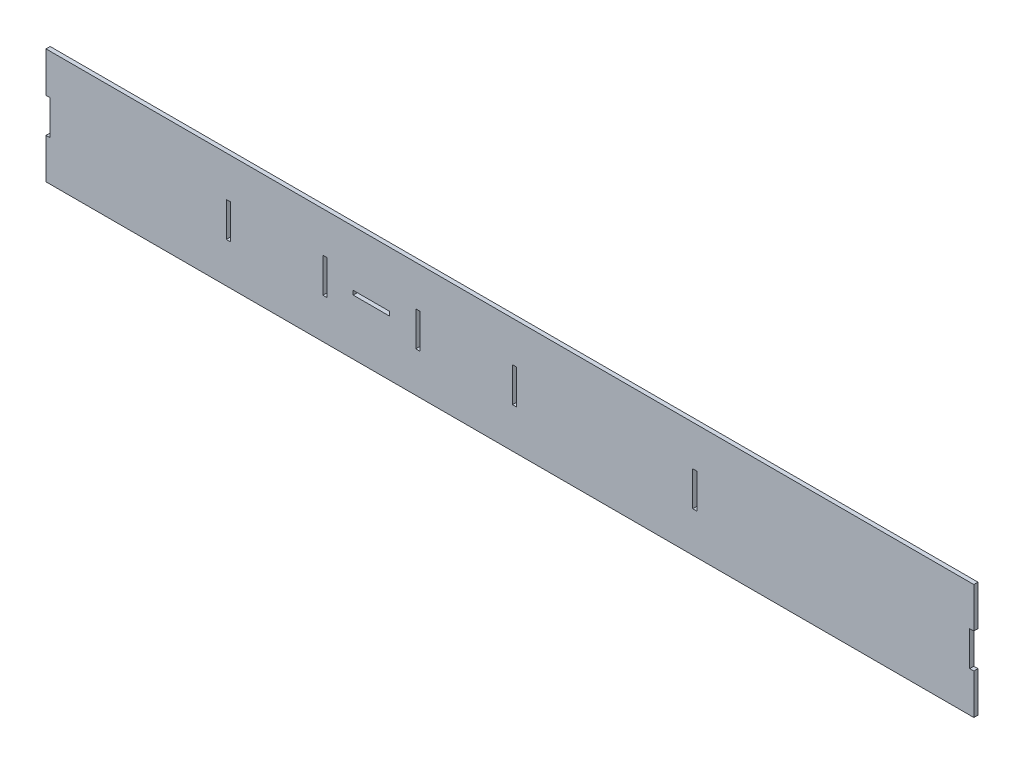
ISO-10303-21;
HEADER;
FILE_DESCRIPTION(('STEP AP214'),'2;1');
FILE_NAME('part.step','',(''),(''),'','','');
FILE_SCHEMA(('AUTOMOTIVE_DESIGN { 1 0 10303 214 1 1 1 1 }'));
ENDSEC;
DATA;
#1=APPLICATION_CONTEXT('core data for automotive mechanical design processes');
#2=APPLICATION_PROTOCOL_DEFINITION('international standard','automotive_design',2000,#1);
#3=PRODUCT_CONTEXT('',#1,'mechanical');
#4=PRODUCT('Part','Part','',(#3));
#5=PRODUCT_RELATED_PRODUCT_CATEGORY('part','',(#4));
#6=PRODUCT_DEFINITION_FORMATION('','',#4);
#7=PRODUCT_DEFINITION_CONTEXT('part definition',#1,'design');
#8=PRODUCT_DEFINITION('design','',#6,#7);
#9=PRODUCT_DEFINITION_SHAPE('','',#8);
#10=(LENGTH_UNIT() NAMED_UNIT(*) SI_UNIT(.MILLI.,.METRE.));
#11=(NAMED_UNIT(*) PLANE_ANGLE_UNIT() SI_UNIT($,.RADIAN.));
#12=(NAMED_UNIT(*) SI_UNIT($,.STERADIAN.) SOLID_ANGLE_UNIT());
#13=UNCERTAINTY_MEASURE_WITH_UNIT(LENGTH_MEASURE(1.E-05),#10,'distance_accuracy_value','');
#14=(GEOMETRIC_REPRESENTATION_CONTEXT(3) GLOBAL_UNCERTAINTY_ASSIGNED_CONTEXT((#13)) GLOBAL_UNIT_ASSIGNED_CONTEXT((#10,
#11,#12)) REPRESENTATION_CONTEXT('',''));
#15=CARTESIAN_POINT('',(0.,0.,0.));
#16=DIRECTION('',(0.,0.,1.));
#17=DIRECTION('',(1.,0.,0.));
#18=AXIS2_PLACEMENT_3D('',#15,#16,#17);
#19=CARTESIAN_POINT('',(0.,-7.86895151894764,1.524));
#20=DIRECTION('',(0.,-1.,0.));
#21=DIRECTION('',(0.,0.,-1.));
#22=AXIS2_PLACEMENT_3D('',#19,#20,#21);
#23=PLANE('',#22);
#24=DIRECTION('',(-1.,0.,0.));
#25=VECTOR('',#24,1.);
#26=CARTESIAN_POINT('',(0.,-7.86895151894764,0.));
#27=LINE('',#26,#25);
#28=CARTESIAN_POINT('',(338.849599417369,-7.86895151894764,0.));
#29=VERTEX_POINT('',#28);
#30=CARTESIAN_POINT('',(337.325599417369,-7.86895151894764,0.));
#31=VERTEX_POINT('',#30);
#32=EDGE_CURVE('E438',#29,#31,#27,.T.);
#33=ORIENTED_EDGE('',*,*,#32,.T.);
#34=DIRECTION('',(0.,0.,-1.));
#35=VECTOR('',#34,1.);
#36=CARTESIAN_POINT('',(337.325599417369,-7.86895151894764,1.524));
#37=LINE('',#36,#35);
#38=CARTESIAN_POINT('',(337.325599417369,-7.86895151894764,1.524));
#39=VERTEX_POINT('',#38);
#40=EDGE_CURVE('E495',#39,#31,#37,.T.);
#41=ORIENTED_EDGE('',*,*,#40,.F.);
#42=DIRECTION('',(-1.,0.,0.));
#43=VECTOR('',#42,1.);
#44=CARTESIAN_POINT('',(0.,-7.86895151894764,1.524));
#45=LINE('',#44,#43);
#46=CARTESIAN_POINT('',(338.849599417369,-7.86895151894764,1.524));
#47=VERTEX_POINT('',#46);
#48=EDGE_CURVE('E373',#47,#39,#45,.T.);
#49=ORIENTED_EDGE('',*,*,#48,.F.);
#50=DIRECTION('',(0.,0.,-1.));
#51=VECTOR('',#50,1.);
#52=CARTESIAN_POINT('',(338.849599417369,-7.86895151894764,1.524));
#53=LINE('',#52,#51);
#54=EDGE_CURVE('E470',#47,#29,#53,.T.);
#55=ORIENTED_EDGE('',*,*,#54,.T.);
#56=EDGE_LOOP('',(#33,#41,#49,#55));
#57=FACE_BOUND('',#56,.T.);
#58=ADVANCED_FACE('F38',(#57),#23,.F.);
#59=CARTESIAN_POINT('',(337.325599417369,0.,1.524));
#60=DIRECTION('',(-1.,0.,0.));
#61=DIRECTION('',(0.,0.,1.));
#62=AXIS2_PLACEMENT_3D('',#59,#60,#61);
#63=PLANE('',#62);
#64=DIRECTION('',(0.,1.,0.));
#65=VECTOR('',#64,1.);
#66=CARTESIAN_POINT('',(337.325599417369,0.,0.));
#67=LINE('',#66,#65);
#68=CARTESIAN_POINT('',(337.325599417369,4.83104848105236,0.));
#69=VERTEX_POINT('',#68);
#70=EDGE_CURVE('E441',#31,#69,#67,.T.);
#71=ORIENTED_EDGE('',*,*,#70,.T.);
#72=DIRECTION('',(0.,0.,-1.));
#73=VECTOR('',#72,1.);
#74=CARTESIAN_POINT('',(337.325599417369,4.83104848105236,1.524));
#75=LINE('',#74,#73);
#76=CARTESIAN_POINT('',(337.325599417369,4.83104848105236,1.524));
#77=VERTEX_POINT('',#76);
#78=EDGE_CURVE('E493',#77,#69,#75,.T.);
#79=ORIENTED_EDGE('',*,*,#78,.F.);
#80=DIRECTION('',(0.,1.,0.));
#81=VECTOR('',#80,1.);
#82=CARTESIAN_POINT('',(337.325599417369,0.,1.524));
#83=LINE('',#82,#81);
#84=EDGE_CURVE('E376',#39,#77,#83,.T.);
#85=ORIENTED_EDGE('',*,*,#84,.F.);
#86=ORIENTED_EDGE('',*,*,#40,.T.);
#87=EDGE_LOOP('',(#71,#79,#85,#86));
#88=FACE_BOUND('',#87,.T.);
#89=ADVANCED_FACE('F572',(#88),#63,.F.);
#90=CARTESIAN_POINT('',(0.,4.83104848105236,1.524));
#91=DIRECTION('',(0.,-1.,0.));
#92=DIRECTION('',(0.,0.,-1.));
#93=AXIS2_PLACEMENT_3D('',#90,#91,#92);
#94=PLANE('',#93);
#95=DIRECTION('',(-1.,0.,0.));
#96=VECTOR('',#95,1.);
#97=CARTESIAN_POINT('',(0.,4.83104848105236,0.));
#98=LINE('',#97,#96);
#99=CARTESIAN_POINT('',(338.849599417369,4.83104848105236,0.));
#100=VERTEX_POINT('',#99);
#101=EDGE_CURVE('E444',#100,#69,#98,.T.);
#102=ORIENTED_EDGE('',*,*,#101,.F.);
#103=DIRECTION('',(0.,0.,-1.));
#104=VECTOR('',#103,1.);
#105=CARTESIAN_POINT('',(338.849599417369,4.83104848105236,1.524));
#106=LINE('',#105,#104);
#107=CARTESIAN_POINT('',(338.849599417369,4.83104848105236,1.524));
#108=VERTEX_POINT('',#107);
#109=EDGE_CURVE('E491',#108,#100,#106,.T.);
#110=ORIENTED_EDGE('',*,*,#109,.F.);
#111=DIRECTION('',(-1.,0.,0.));
#112=VECTOR('',#111,1.);
#113=CARTESIAN_POINT('',(0.,4.83104848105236,1.524));
#114=LINE('',#113,#112);
#115=EDGE_CURVE('E378',#108,#77,#114,.T.);
#116=ORIENTED_EDGE('',*,*,#115,.T.);
#117=ORIENTED_EDGE('',*,*,#78,.T.);
#118=EDGE_LOOP('',(#102,#110,#116,#117));
#119=FACE_BOUND('',#118,.T.);
#120=ADVANCED_FACE('F578',(#119),#94,.T.);
#121=CARTESIAN_POINT('',(338.849599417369,0.,1.524));
#122=DIRECTION('',(-1.,0.,0.));
#123=DIRECTION('',(0.,0.,1.));
#124=AXIS2_PLACEMENT_3D('',#121,#122,#123);
#125=PLANE('',#124);
#126=DIRECTION('',(0.,1.,0.));
#127=VECTOR('',#126,1.);
#128=CARTESIAN_POINT('',(338.849599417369,0.,0.));
#129=LINE('',#128,#127);
#130=CARTESIAN_POINT('',(338.849599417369,19.6067339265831,0.));
#131=VERTEX_POINT('',#130);
#132=EDGE_CURVE('E447',#100,#131,#129,.T.);
#133=ORIENTED_EDGE('',*,*,#132,.T.);
#134=DIRECTION('',(0.,0.,-1.));
#135=VECTOR('',#134,1.);
#136=CARTESIAN_POINT('',(338.849599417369,19.6067339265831,1.524));
#137=LINE('',#136,#135);
#138=CARTESIAN_POINT('',(338.849599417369,19.6067339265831,1.524));
#139=VERTEX_POINT('',#138);
#140=EDGE_CURVE('E489',#139,#131,#137,.T.);
#141=ORIENTED_EDGE('',*,*,#140,.F.);
#142=DIRECTION('',(0.,1.,0.));
#143=VECTOR('',#142,1.);
#144=CARTESIAN_POINT('',(338.849599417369,0.,1.524));
#145=LINE('',#144,#143);
#146=EDGE_CURVE('E381',#108,#139,#145,.T.);
#147=ORIENTED_EDGE('',*,*,#146,.F.);
#148=ORIENTED_EDGE('',*,*,#109,.T.);
#149=EDGE_LOOP('',(#133,#141,#147,#148));
#150=FACE_BOUND('',#149,.T.);
#151=ADVANCED_FACE('F667',(#150),#125,.F.);
#152=CARTESIAN_POINT('',(0.,19.6067339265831,1.524));
#153=DIRECTION('',(0.,1.,0.));
#154=DIRECTION('',(0.,0.,1.));
#155=AXIS2_PLACEMENT_3D('',#152,#153,#154);
#156=PLANE('',#155);
#157=DIRECTION('',(1.,0.,0.));
#158=VECTOR('',#157,1.);
#159=CARTESIAN_POINT('',(0.,19.6067339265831,0.));
#160=LINE('',#159,#158);
#161=CARTESIAN_POINT('',(-1.524,19.6067339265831,0.));
#162=VERTEX_POINT('',#161);
#163=EDGE_CURVE('E450',#162,#131,#160,.T.);
#164=ORIENTED_EDGE('',*,*,#163,.F.);
#165=DIRECTION('',(0.,0.,-1.));
#166=VECTOR('',#165,1.);
#167=CARTESIAN_POINT('',(-1.524,19.6067339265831,1.524));
#168=LINE('',#167,#166);
#169=CARTESIAN_POINT('',(-1.524,19.6067339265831,1.524));
#170=VERTEX_POINT('',#169);
#171=EDGE_CURVE('E487',#170,#162,#168,.T.);
#172=ORIENTED_EDGE('',*,*,#171,.F.);
#173=DIRECTION('',(1.,0.,0.));
#174=VECTOR('',#173,1.);
#175=CARTESIAN_POINT('',(0.,19.6067339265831,1.524));
#176=LINE('',#175,#174);
#177=EDGE_CURVE('E383',#170,#139,#176,.T.);
#178=ORIENTED_EDGE('',*,*,#177,.T.);
#179=ORIENTED_EDGE('',*,*,#140,.T.);
#180=EDGE_LOOP('',(#164,#172,#178,#179));
#181=FACE_BOUND('',#180,.T.);
#182=ADVANCED_FACE('F671',(#181),#156,.T.);
#183=CARTESIAN_POINT('',(-1.524,0.,1.524));
#184=DIRECTION('',(-1.,0.,0.));
#185=DIRECTION('',(0.,0.,1.));
#186=AXIS2_PLACEMENT_3D('',#183,#184,#185);
#187=PLANE('',#186);
#188=DIRECTION('',(0.,1.,0.));
#189=VECTOR('',#188,1.);
#190=CARTESIAN_POINT('',(-1.524,0.,0.));
#191=LINE('',#190,#189);
#192=CARTESIAN_POINT('',(-1.524,4.83104848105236,0.));
#193=VERTEX_POINT('',#192);
#194=EDGE_CURVE('E453',#193,#162,#191,.T.);
#195=ORIENTED_EDGE('',*,*,#194,.F.);
#196=DIRECTION('',(0.,0.,-1.));
#197=VECTOR('',#196,1.);
#198=CARTESIAN_POINT('',(-1.524,4.83104848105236,1.524));
#199=LINE('',#198,#197);
#200=CARTESIAN_POINT('',(-1.524,4.83104848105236,1.524));
#201=VERTEX_POINT('',#200);
#202=EDGE_CURVE('E485',#201,#193,#199,.T.);
#203=ORIENTED_EDGE('',*,*,#202,.F.);
#204=DIRECTION('',(0.,1.,0.));
#205=VECTOR('',#204,1.);
#206=CARTESIAN_POINT('',(-1.524,0.,1.524));
#207=LINE('',#206,#205);
#208=EDGE_CURVE('E387',#201,#170,#207,.T.);
#209=ORIENTED_EDGE('',*,*,#208,.T.);
#210=ORIENTED_EDGE('',*,*,#171,.T.);
#211=EDGE_LOOP('',(#195,#203,#209,#210));
#212=FACE_BOUND('',#211,.T.);
#213=ADVANCED_FACE('F674',(#212),#187,.T.);
#214=CARTESIAN_POINT('',(0.,4.83104848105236,1.524));
#215=DIRECTION('',(0.,-1.,0.));
#216=DIRECTION('',(0.,0.,-1.));
#217=AXIS2_PLACEMENT_3D('',#214,#215,#216);
#218=PLANE('',#217);
#219=DIRECTION('',(-1.,0.,0.));
#220=VECTOR('',#219,1.);
#221=CARTESIAN_POINT('',(0.,4.83104848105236,0.));
#222=LINE('',#221,#220);
#223=CARTESIAN_POINT('',(0.,4.83104848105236,0.));
#224=VERTEX_POINT('',#223);
#225=EDGE_CURVE('E456',#224,#193,#222,.T.);
#226=ORIENTED_EDGE('',*,*,#225,.F.);
#227=DIRECTION('',(0.,0.,-1.));
#228=VECTOR('',#227,1.);
#229=CARTESIAN_POINT('',(0.,4.83104848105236,1.524));
#230=LINE('',#229,#228);
#231=CARTESIAN_POINT('',(0.,4.83104848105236,1.524));
#232=VERTEX_POINT('',#231);
#233=EDGE_CURVE('E483',#232,#224,#230,.T.);
#234=ORIENTED_EDGE('',*,*,#233,.F.);
#235=DIRECTION('',(-1.,0.,0.));
#236=VECTOR('',#235,1.);
#237=CARTESIAN_POINT('',(0.,4.83104848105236,1.524));
#238=LINE('',#237,#236);
#239=EDGE_CURVE('E390',#232,#201,#238,.T.);
#240=ORIENTED_EDGE('',*,*,#239,.T.);
#241=ORIENTED_EDGE('',*,*,#202,.T.);
#242=EDGE_LOOP('',(#226,#234,#240,#241));
#243=FACE_BOUND('',#242,.T.);
#244=ADVANCED_FACE('F679',(#243),#218,.T.);
#245=CARTESIAN_POINT('',(0.,0.,1.524));
#246=DIRECTION('',(-1.,0.,0.));
#247=DIRECTION('',(0.,0.,1.));
#248=AXIS2_PLACEMENT_3D('',#245,#246,#247);
#249=PLANE('',#248);
#250=DIRECTION('',(0.,1.,0.));
#251=VECTOR('',#250,1.);
#252=CARTESIAN_POINT('',(0.,0.,0.));
#253=LINE('',#252,#251);
#254=CARTESIAN_POINT('',(0.,-7.86895151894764,0.));
#255=VERTEX_POINT('',#254);
#256=EDGE_CURVE('E459',#255,#224,#253,.T.);
#257=ORIENTED_EDGE('',*,*,#256,.F.);
#258=DIRECTION('',(0.,0.,-1.));
#259=VECTOR('',#258,1.);
#260=CARTESIAN_POINT('',(0.,-7.86895151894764,1.524));
#261=LINE('',#260,#259);
#262=CARTESIAN_POINT('',(0.,-7.86895151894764,1.524));
#263=VERTEX_POINT('',#262);
#264=EDGE_CURVE('E481',#263,#255,#261,.T.);
#265=ORIENTED_EDGE('',*,*,#264,.F.);
#266=DIRECTION('',(0.,1.,0.));
#267=VECTOR('',#266,1.);
#268=CARTESIAN_POINT('',(0.,0.,1.524));
#269=LINE('',#268,#267);
#270=EDGE_CURVE('E393',#263,#232,#269,.T.);
#271=ORIENTED_EDGE('',*,*,#270,.T.);
#272=ORIENTED_EDGE('',*,*,#233,.T.);
#273=EDGE_LOOP('',(#257,#265,#271,#272));
#274=FACE_BOUND('',#273,.T.);
#275=ADVANCED_FACE('F682',(#274),#249,.T.);
#276=CARTESIAN_POINT('',(0.,-7.86895151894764,1.524));
#277=DIRECTION('',(0.,1.,0.));
#278=DIRECTION('',(0.,0.,1.));
#279=AXIS2_PLACEMENT_3D('',#276,#277,#278);
#280=PLANE('',#279);
#281=DIRECTION('',(1.,0.,0.));
#282=VECTOR('',#281,1.);
#283=CARTESIAN_POINT('',(0.,-7.86895151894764,0.));
#284=LINE('',#283,#282);
#285=CARTESIAN_POINT('',(-1.524,-7.86895151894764,0.));
#286=VERTEX_POINT('',#285);
#287=EDGE_CURVE('E462',#286,#255,#284,.T.);
#288=ORIENTED_EDGE('',*,*,#287,.F.);
#289=DIRECTION('',(0.,0.,-1.));
#290=VECTOR('',#289,1.);
#291=CARTESIAN_POINT('',(-1.524,-7.86895151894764,1.524));
#292=LINE('',#291,#290);
#293=CARTESIAN_POINT('',(-1.524,-7.86895151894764,1.524));
#294=VERTEX_POINT('',#293);
#295=EDGE_CURVE('E479',#294,#286,#292,.T.);
#296=ORIENTED_EDGE('',*,*,#295,.F.);
#297=DIRECTION('',(1.,0.,0.));
#298=VECTOR('',#297,1.);
#299=CARTESIAN_POINT('',(0.,-7.86895151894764,1.524));
#300=LINE('',#299,#298);
#301=EDGE_CURVE('E396',#294,#263,#300,.T.);
#302=ORIENTED_EDGE('',*,*,#301,.T.);
#303=ORIENTED_EDGE('',*,*,#264,.T.);
#304=EDGE_LOOP('',(#288,#296,#302,#303));
#305=FACE_BOUND('',#304,.T.);
#306=ADVANCED_FACE('F687',(#305),#280,.T.);
#307=CARTESIAN_POINT('',(-1.524,0.,1.524));
#308=DIRECTION('',(-1.,0.,0.));
#309=DIRECTION('',(0.,0.,1.));
#310=AXIS2_PLACEMENT_3D('',#307,#308,#309);
#311=PLANE('',#310);
#312=DIRECTION('',(0.,1.,0.));
#313=VECTOR('',#312,1.);
#314=CARTESIAN_POINT('',(-1.524,0.,0.));
#315=LINE('',#314,#313);
#316=CARTESIAN_POINT('',(-1.524,-22.6446369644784,0.));
#317=VERTEX_POINT('',#316);
#318=EDGE_CURVE('E465',#317,#286,#315,.T.);
#319=ORIENTED_EDGE('',*,*,#318,.F.);
#320=DIRECTION('',(0.,0.,-1.));
#321=VECTOR('',#320,1.);
#322=CARTESIAN_POINT('',(-1.524,-22.6446369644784,1.524));
#323=LINE('',#322,#321);
#324=CARTESIAN_POINT('',(-1.524,-22.6446369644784,1.524));
#325=VERTEX_POINT('',#324);
#326=EDGE_CURVE('E477',#325,#317,#323,.T.);
#327=ORIENTED_EDGE('',*,*,#326,.F.);
#328=DIRECTION('',(0.,1.,0.));
#329=VECTOR('',#328,1.);
#330=CARTESIAN_POINT('',(-1.524,0.,1.524));
#331=LINE('',#330,#329);
#332=EDGE_CURVE('E399',#325,#294,#331,.T.);
#333=ORIENTED_EDGE('',*,*,#332,.T.);
#334=ORIENTED_EDGE('',*,*,#295,.T.);
#335=EDGE_LOOP('',(#319,#327,#333,#334));
#336=FACE_BOUND('',#335,.T.);
#337=ADVANCED_FACE('F690',(#336),#311,.T.);
#338=CARTESIAN_POINT('',(0.,-22.6446369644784,1.524));
#339=DIRECTION('',(0.,1.,0.));
#340=DIRECTION('',(0.,0.,1.));
#341=AXIS2_PLACEMENT_3D('',#338,#339,#340);
#342=PLANE('',#341);
#343=DIRECTION('',(1.,0.,0.));
#344=VECTOR('',#343,1.);
#345=CARTESIAN_POINT('',(0.,-22.6446369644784,0.));
#346=LINE('',#345,#344);
#347=CARTESIAN_POINT('',(338.849599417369,-22.6446369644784,0.));
#348=VERTEX_POINT('',#347);
#349=EDGE_CURVE('E468',#317,#348,#346,.T.);
#350=ORIENTED_EDGE('',*,*,#349,.T.);
#351=DIRECTION('',(0.,0.,-1.));
#352=VECTOR('',#351,1.);
#353=CARTESIAN_POINT('',(338.849599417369,-22.6446369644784,1.524));
#354=LINE('',#353,#352);
#355=CARTESIAN_POINT('',(338.849599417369,-22.6446369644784,1.524));
#356=VERTEX_POINT('',#355);
#357=EDGE_CURVE('E473',#356,#348,#354,.T.);
#358=ORIENTED_EDGE('',*,*,#357,.F.);
#359=DIRECTION('',(1.,0.,0.));
#360=VECTOR('',#359,1.);
#361=CARTESIAN_POINT('',(0.,-22.6446369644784,1.524));
#362=LINE('',#361,#360);
#363=EDGE_CURVE('E402',#325,#356,#362,.T.);
#364=ORIENTED_EDGE('',*,*,#363,.F.);
#365=ORIENTED_EDGE('',*,*,#326,.T.);
#366=EDGE_LOOP('',(#350,#358,#364,#365));
#367=FACE_BOUND('',#366,.T.);
#368=ADVANCED_FACE('F601',(#367),#342,.F.);
#369=CARTESIAN_POINT('',(237.249599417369,0.,1.524));
#370=DIRECTION('',(-1.,0.,0.));
#371=DIRECTION('',(0.,0.,1.));
#372=AXIS2_PLACEMENT_3D('',#369,#370,#371);
#373=PLANE('',#372);
#374=DIRECTION('',(0.,1.,0.));
#375=VECTOR('',#374,1.);
#376=CARTESIAN_POINT('',(237.249599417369,0.,0.));
#377=LINE('',#376,#375);
#378=CARTESIAN_POINT('',(237.249599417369,-7.86895151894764,0.));
#379=VERTEX_POINT('',#378);
#380=CARTESIAN_POINT('',(237.249599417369,4.83104848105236,0.));
#381=VERTEX_POINT('',#380);
#382=EDGE_CURVE('E426',#379,#381,#377,.T.);
#383=ORIENTED_EDGE('',*,*,#382,.F.);
#384=DIRECTION('',(0.,0.,-1.));
#385=VECTOR('',#384,1.);
#386=CARTESIAN_POINT('',(237.249599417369,-7.86895151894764,1.524));
#387=LINE('',#386,#385);
#388=CARTESIAN_POINT('',(237.249599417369,-7.86895151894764,1.524));
#389=VERTEX_POINT('',#388);
#390=EDGE_CURVE('E474',#389,#379,#387,.T.);
#391=ORIENTED_EDGE('',*,*,#390,.F.);
#392=DIRECTION('',(0.,1.,0.));
#393=VECTOR('',#392,1.);
#394=CARTESIAN_POINT('',(237.249599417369,0.,1.524));
#395=LINE('',#394,#393);
#396=CARTESIAN_POINT('',(237.249599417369,4.83104848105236,1.524));
#397=VERTEX_POINT('',#396);
#398=EDGE_CURVE('E362',#389,#397,#395,.T.);
#399=ORIENTED_EDGE('',*,*,#398,.T.);
#400=DIRECTION('',(0.,0.,-1.));
#401=VECTOR('',#400,1.);
#402=CARTESIAN_POINT('',(237.249599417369,4.83104848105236,1.524));
#403=LINE('',#402,#401);
#404=EDGE_CURVE('E499',#397,#381,#403,.T.);
#405=ORIENTED_EDGE('',*,*,#404,.T.);
#406=EDGE_LOOP('',(#383,#391,#399,#405));
#407=FACE_BOUND('',#406,.T.);
#408=ADVANCED_FACE('F597',(#407),#373,.T.);
#409=CARTESIAN_POINT('',(0.,-7.86895151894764,1.524));
#410=DIRECTION('',(0.,1.,0.));
#411=DIRECTION('',(0.,0.,1.));
#412=AXIS2_PLACEMENT_3D('',#409,#410,#411);
#413=PLANE('',#412);
#414=DIRECTION('',(1.,0.,0.));
#415=VECTOR('',#414,1.);
#416=CARTESIAN_POINT('',(0.,-7.86895151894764,0.));
#417=LINE('',#416,#415);
#418=CARTESIAN_POINT('',(235.725599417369,-7.86895151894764,0.));
#419=VERTEX_POINT('',#418);
#420=EDGE_CURVE('E429',#419,#379,#417,.T.);
#421=ORIENTED_EDGE('',*,*,#420,.F.);
#422=DIRECTION('',(0.,0.,-1.));
#423=VECTOR('',#422,1.);
#424=CARTESIAN_POINT('',(235.725599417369,-7.86895151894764,1.524));
#425=LINE('',#424,#423);
#426=CARTESIAN_POINT('',(235.725599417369,-7.86895151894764,1.524));
#427=VERTEX_POINT('',#426);
#428=EDGE_CURVE('E505',#427,#419,#425,.T.);
#429=ORIENTED_EDGE('',*,*,#428,.F.);
#430=DIRECTION('',(1.,0.,0.));
#431=VECTOR('',#430,1.);
#432=CARTESIAN_POINT('',(0.,-7.86895151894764,1.524));
#433=LINE('',#432,#431);
#434=EDGE_CURVE('E365',#427,#389,#433,.T.);
#435=ORIENTED_EDGE('',*,*,#434,.T.);
#436=ORIENTED_EDGE('',*,*,#390,.T.);
#437=EDGE_LOOP('',(#421,#429,#435,#436));
#438=FACE_BOUND('',#437,.T.);
#439=ADVANCED_FACE('F593',(#438),#413,.T.);
#440=CARTESIAN_POINT('',(235.725599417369,0.,1.524));
#441=DIRECTION('',(-1.,0.,0.));
#442=DIRECTION('',(0.,0.,1.));
#443=AXIS2_PLACEMENT_3D('',#440,#441,#442);
#444=PLANE('',#443);
#445=DIRECTION('',(0.,1.,0.));
#446=VECTOR('',#445,1.);
#447=CARTESIAN_POINT('',(235.725599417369,0.,0.));
#448=LINE('',#447,#446);
#449=CARTESIAN_POINT('',(235.725599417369,4.83104848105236,0.));
#450=VERTEX_POINT('',#449);
#451=EDGE_CURVE('E432',#419,#450,#448,.T.);
#452=ORIENTED_EDGE('',*,*,#451,.T.);
#453=DIRECTION('',(0.,0.,-1.));
#454=VECTOR('',#453,1.);
#455=CARTESIAN_POINT('',(235.725599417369,4.83104848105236,1.524));
#456=LINE('',#455,#454);
#457=CARTESIAN_POINT('',(235.725599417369,4.83104848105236,1.524));
#458=VERTEX_POINT('',#457);
#459=EDGE_CURVE('E501',#458,#450,#456,.T.);
#460=ORIENTED_EDGE('',*,*,#459,.F.);
#461=DIRECTION('',(0.,1.,0.));
#462=VECTOR('',#461,1.);
#463=CARTESIAN_POINT('',(235.725599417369,0.,1.524));
#464=LINE('',#463,#462);
#465=EDGE_CURVE('E368',#427,#458,#464,.T.);
#466=ORIENTED_EDGE('',*,*,#465,.F.);
#467=ORIENTED_EDGE('',*,*,#428,.T.);
#468=EDGE_LOOP('',(#452,#460,#466,#467));
#469=FACE_BOUND('',#468,.T.);
#470=ADVANCED_FACE('F589',(#469),#444,.F.);
#471=CARTESIAN_POINT('',(135.649599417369,0.,1.524));
#472=DIRECTION('',(-1.,0.,0.));
#473=DIRECTION('',(0.,0.,1.));
#474=AXIS2_PLACEMENT_3D('',#471,#472,#473);
#475=PLANE('',#474);
#476=DIRECTION('',(0.,1.,0.));
#477=VECTOR('',#476,1.);
#478=CARTESIAN_POINT('',(135.649599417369,0.,0.));
#479=LINE('',#478,#477);
#480=CARTESIAN_POINT('',(135.649599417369,-7.86895151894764,0.));
#481=VERTEX_POINT('',#480);
#482=CARTESIAN_POINT('',(135.649599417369,4.83104848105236,0.));
#483=VERTEX_POINT('',#482);
#484=EDGE_CURVE('E414',#481,#483,#479,.T.);
#485=ORIENTED_EDGE('',*,*,#484,.F.);
#486=DIRECTION('',(0.,0.,-1.));
#487=VECTOR('',#486,1.);
#488=CARTESIAN_POINT('',(135.649599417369,-7.86895151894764,1.524));
#489=LINE('',#488,#487);
#490=CARTESIAN_POINT('',(135.649599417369,-7.86895151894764,1.524));
#491=VERTEX_POINT('',#490);
#492=EDGE_CURVE('E502',#491,#481,#489,.T.);
#493=ORIENTED_EDGE('',*,*,#492,.F.);
#494=DIRECTION('',(0.,1.,0.));
#495=VECTOR('',#494,1.);
#496=CARTESIAN_POINT('',(135.649599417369,0.,1.524));
#497=LINE('',#496,#495);
#498=CARTESIAN_POINT('',(135.649599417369,4.83104848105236,1.524));
#499=VERTEX_POINT('',#498);
#500=EDGE_CURVE('E351',#491,#499,#497,.T.);
#501=ORIENTED_EDGE('',*,*,#500,.T.);
#502=DIRECTION('',(0.,0.,-1.));
#503=VECTOR('',#502,1.);
#504=CARTESIAN_POINT('',(135.649599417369,4.83104848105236,1.524));
#505=LINE('',#504,#503);
#506=EDGE_CURVE('E508',#499,#483,#505,.T.);
#507=ORIENTED_EDGE('',*,*,#506,.T.);
#508=EDGE_LOOP('',(#485,#493,#501,#507));
#509=FACE_BOUND('',#508,.T.);
#510=ADVANCED_FACE('F592',(#509),#475,.T.);
#511=CARTESIAN_POINT('',(0.,-7.86895151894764,1.524));
#512=DIRECTION('',(0.,1.,0.));
#513=DIRECTION('',(0.,0.,1.));
#514=AXIS2_PLACEMENT_3D('',#511,#512,#513);
#515=PLANE('',#514);
#516=DIRECTION('',(1.,0.,0.));
#517=VECTOR('',#516,1.);
#518=CARTESIAN_POINT('',(0.,-7.86895151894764,0.));
#519=LINE('',#518,#517);
#520=CARTESIAN_POINT('',(134.125599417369,-7.86895151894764,0.));
#521=VERTEX_POINT('',#520);
#522=EDGE_CURVE('E417',#521,#481,#519,.T.);
#523=ORIENTED_EDGE('',*,*,#522,.F.);
#524=DIRECTION('',(0.,0.,-1.));
#525=VECTOR('',#524,1.);
#526=CARTESIAN_POINT('',(134.125599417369,-7.86895151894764,1.524));
#527=LINE('',#526,#525);
#528=CARTESIAN_POINT('',(134.125599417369,-7.86895151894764,1.524));
#529=VERTEX_POINT('',#528);
#530=EDGE_CURVE('E514',#529,#521,#527,.T.);
#531=ORIENTED_EDGE('',*,*,#530,.F.);
#532=DIRECTION('',(1.,0.,0.));
#533=VECTOR('',#532,1.);
#534=CARTESIAN_POINT('',(0.,-7.86895151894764,1.524));
#535=LINE('',#534,#533);
#536=EDGE_CURVE('E354',#529,#491,#535,.T.);
#537=ORIENTED_EDGE('',*,*,#536,.T.);
#538=ORIENTED_EDGE('',*,*,#492,.T.);
#539=EDGE_LOOP('',(#523,#531,#537,#538));
#540=FACE_BOUND('',#539,.T.);
#541=ADVANCED_FACE('F610',(#540),#515,.T.);
#542=CARTESIAN_POINT('',(134.125599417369,0.,1.524));
#543=DIRECTION('',(-1.,0.,0.));
#544=DIRECTION('',(0.,0.,1.));
#545=AXIS2_PLACEMENT_3D('',#542,#543,#544);
#546=PLANE('',#545);
#547=DIRECTION('',(0.,1.,0.));
#548=VECTOR('',#547,1.);
#549=CARTESIAN_POINT('',(134.125599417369,0.,0.));
#550=LINE('',#549,#548);
#551=CARTESIAN_POINT('',(134.125599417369,4.83104848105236,0.));
#552=VERTEX_POINT('',#551);
#553=EDGE_CURVE('E420',#521,#552,#550,.T.);
#554=ORIENTED_EDGE('',*,*,#553,.T.);
#555=DIRECTION('',(0.,0.,-1.));
#556=VECTOR('',#555,1.);
#557=CARTESIAN_POINT('',(134.125599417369,4.83104848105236,1.524));
#558=LINE('',#557,#556);
#559=CARTESIAN_POINT('',(134.125599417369,4.83104848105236,1.524));
#560=VERTEX_POINT('',#559);
#561=EDGE_CURVE('E510',#560,#552,#558,.T.);
#562=ORIENTED_EDGE('',*,*,#561,.F.);
#563=DIRECTION('',(0.,1.,0.));
#564=VECTOR('',#563,1.);
#565=CARTESIAN_POINT('',(134.125599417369,0.,1.524));
#566=LINE('',#565,#564);
#567=EDGE_CURVE('E357',#529,#560,#566,.T.);
#568=ORIENTED_EDGE('',*,*,#567,.F.);
#569=ORIENTED_EDGE('',*,*,#530,.T.);
#570=EDGE_LOOP('',(#554,#562,#568,#569));
#571=FACE_BOUND('',#570,.T.);
#572=ADVANCED_FACE('F607',(#571),#546,.F.);
#573=CARTESIAN_POINT('',(100.076,0.,1.524));
#574=DIRECTION('',(1.,0.,0.));
#575=DIRECTION('',(0.,0.,-1.));
#576=AXIS2_PLACEMENT_3D('',#573,#574,#575);
#577=PLANE('',#576);
#578=DIRECTION('',(0.,-1.,0.));
#579=VECTOR('',#578,1.);
#580=CARTESIAN_POINT('',(100.076,0.,0.));
#581=LINE('',#580,#579);
#582=CARTESIAN_POINT('',(100.076,4.83104848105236,0.));
#583=VERTEX_POINT('',#582);
#584=CARTESIAN_POINT('',(100.076,-7.86895151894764,0.));
#585=VERTEX_POINT('',#584);
#586=EDGE_CURVE('E333',#583,#585,#581,.T.);
#587=ORIENTED_EDGE('',*,*,#586,.F.);
#588=DIRECTION('',(0.,0.,-1.));
#589=VECTOR('',#588,1.);
#590=CARTESIAN_POINT('',(100.076,4.83104848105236,1.524));
#591=LINE('',#590,#589);
#592=CARTESIAN_POINT('',(100.076,4.83104848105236,1.524));
#593=VERTEX_POINT('',#592);
#594=EDGE_CURVE('E511',#593,#583,#591,.T.);
#595=ORIENTED_EDGE('',*,*,#594,.F.);
#596=DIRECTION('',(0.,-1.,0.));
#597=VECTOR('',#596,1.);
#598=CARTESIAN_POINT('',(100.076,0.,1.524));
#599=LINE('',#598,#597);
#600=CARTESIAN_POINT('',(100.076,-7.86895151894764,1.524));
#601=VERTEX_POINT('',#600);
#602=EDGE_CURVE('E340',#593,#601,#599,.T.);
#603=ORIENTED_EDGE('',*,*,#602,.T.);
#604=DIRECTION('',(0.,0.,-1.));
#605=VECTOR('',#604,1.);
#606=CARTESIAN_POINT('',(100.076,-7.86895151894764,1.524));
#607=LINE('',#606,#605);
#608=EDGE_CURVE('E517',#601,#585,#607,.T.);
#609=ORIENTED_EDGE('',*,*,#608,.T.);
#610=EDGE_LOOP('',(#587,#595,#603,#609));
#611=FACE_BOUND('',#610,.T.);
#612=ADVANCED_FACE('F40',(#611),#577,.T.);
#613=CARTESIAN_POINT('',(0.,4.83104848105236,1.524));
#614=DIRECTION('',(0.,-1.,0.));
#615=DIRECTION('',(0.,0.,-1.));
#616=AXIS2_PLACEMENT_3D('',#613,#614,#615);
#617=PLANE('',#616);
#618=DIRECTION('',(-1.,0.,0.));
#619=VECTOR('',#618,1.);
#620=CARTESIAN_POINT('',(0.,4.83104848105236,0.));
#621=LINE('',#620,#619);
#622=CARTESIAN_POINT('',(101.6,4.83104848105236,0.));
#623=VERTEX_POINT('',#622);
#624=EDGE_CURVE('E406',#623,#583,#621,.T.);
#625=ORIENTED_EDGE('',*,*,#624,.F.);
#626=DIRECTION('',(0.,0.,-1.));
#627=VECTOR('',#626,1.);
#628=CARTESIAN_POINT('',(101.6,4.83104848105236,1.524));
#629=LINE('',#628,#627);
#630=CARTESIAN_POINT('',(101.6,4.83104848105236,1.524));
#631=VERTEX_POINT('',#630);
#632=EDGE_CURVE('E522',#631,#623,#629,.T.);
#633=ORIENTED_EDGE('',*,*,#632,.F.);
#634=DIRECTION('',(-1.,0.,0.));
#635=VECTOR('',#634,1.);
#636=CARTESIAN_POINT('',(0.,4.83104848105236,1.524));
#637=LINE('',#636,#635);
#638=EDGE_CURVE('E343',#631,#593,#637,.T.);
#639=ORIENTED_EDGE('',*,*,#638,.T.);
#640=ORIENTED_EDGE('',*,*,#594,.T.);
#641=EDGE_LOOP('',(#625,#633,#639,#640));
#642=FACE_BOUND('',#641,.T.);
#643=ADVANCED_FACE('F623',(#642),#617,.T.);
#644=CARTESIAN_POINT('',(101.6,0.,1.524));
#645=DIRECTION('',(1.,0.,0.));
#646=DIRECTION('',(0.,0.,-1.));
#647=AXIS2_PLACEMENT_3D('',#644,#645,#646);
#648=PLANE('',#647);
#649=DIRECTION('',(0.,-1.,0.));
#650=VECTOR('',#649,1.);
#651=CARTESIAN_POINT('',(101.6,0.,0.));
#652=LINE('',#651,#650);
#653=CARTESIAN_POINT('',(101.6,-7.86895151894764,0.));
#654=VERTEX_POINT('',#653);
#655=EDGE_CURVE('E409',#623,#654,#652,.T.);
#656=ORIENTED_EDGE('',*,*,#655,.T.);
#657=DIRECTION('',(0.,0.,-1.));
#658=VECTOR('',#657,1.);
#659=CARTESIAN_POINT('',(101.6,-7.86895151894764,1.524));
#660=LINE('',#659,#658);
#661=CARTESIAN_POINT('',(101.6,-7.86895151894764,1.524));
#662=VERTEX_POINT('',#661);
#663=EDGE_CURVE('E519',#662,#654,#660,.T.);
#664=ORIENTED_EDGE('',*,*,#663,.F.);
#665=DIRECTION('',(0.,-1.,0.));
#666=VECTOR('',#665,1.);
#667=CARTESIAN_POINT('',(101.6,0.,1.524));
#668=LINE('',#667,#666);
#669=EDGE_CURVE('E347',#631,#662,#668,.T.);
#670=ORIENTED_EDGE('',*,*,#669,.F.);
#671=ORIENTED_EDGE('',*,*,#632,.T.);
#672=EDGE_LOOP('',(#656,#664,#670,#671));
#673=FACE_BOUND('',#672,.T.);
#674=ADVANCED_FACE('F587',(#673),#648,.F.);
#675=CARTESIAN_POINT('',(0.,4.83104848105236,1.524));
#676=DIRECTION('',(0.,1.,0.));
#677=DIRECTION('',(0.,0.,1.));
#678=AXIS2_PLACEMENT_3D('',#675,#676,#677);
#679=PLANE('',#678);
#680=DIRECTION('',(1.,0.,0.));
#681=VECTOR('',#680,1.);
#682=CARTESIAN_POINT('',(0.,4.83104848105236,0.));
#683=LINE('',#682,#681);
#684=EDGE_CURVE('E435',#450,#381,#683,.T.);
#685=ORIENTED_EDGE('',*,*,#684,.T.);
#686=ORIENTED_EDGE('',*,*,#404,.F.);
#687=DIRECTION('',(1.,0.,0.));
#688=VECTOR('',#687,1.);
#689=CARTESIAN_POINT('',(0.,4.83104848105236,1.524));
#690=LINE('',#689,#688);
#691=EDGE_CURVE('E371',#458,#397,#690,.T.);
#692=ORIENTED_EDGE('',*,*,#691,.F.);
#693=ORIENTED_EDGE('',*,*,#459,.T.);
#694=EDGE_LOOP('',(#685,#686,#692,#693));
#695=FACE_BOUND('',#694,.T.);
#696=ADVANCED_FACE('F583',(#695),#679,.F.);
#697=CARTESIAN_POINT('',(0.,4.83104848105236,1.524));
#698=DIRECTION('',(0.,1.,0.));
#699=DIRECTION('',(0.,0.,1.));
#700=AXIS2_PLACEMENT_3D('',#697,#698,#699);
#701=PLANE('',#700);
#702=DIRECTION('',(1.,0.,0.));
#703=VECTOR('',#702,1.);
#704=CARTESIAN_POINT('',(0.,4.83104848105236,0.));
#705=LINE('',#704,#703);
#706=EDGE_CURVE('E423',#552,#483,#705,.T.);
#707=ORIENTED_EDGE('',*,*,#706,.T.);
#708=ORIENTED_EDGE('',*,*,#506,.F.);
#709=DIRECTION('',(1.,0.,0.));
#710=VECTOR('',#709,1.);
#711=CARTESIAN_POINT('',(0.,4.83104848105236,1.524));
#712=LINE('',#711,#710);
#713=EDGE_CURVE('E360',#560,#499,#712,.T.);
#714=ORIENTED_EDGE('',*,*,#713,.F.);
#715=ORIENTED_EDGE('',*,*,#561,.T.);
#716=EDGE_LOOP('',(#707,#708,#714,#715));
#717=FACE_BOUND('',#716,.T.);
#718=ADVANCED_FACE('F586',(#717),#701,.F.);
#719=CARTESIAN_POINT('',(0.,-7.86895151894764,1.524));
#720=DIRECTION('',(0.,-1.,0.));
#721=DIRECTION('',(0.,0.,-1.));
#722=AXIS2_PLACEMENT_3D('',#719,#720,#721);
#723=PLANE('',#722);
#724=DIRECTION('',(-1.,0.,0.));
#725=VECTOR('',#724,1.);
#726=CARTESIAN_POINT('',(0.,-7.86895151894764,0.));
#727=LINE('',#726,#725);
#728=EDGE_CURVE('E411',#654,#585,#727,.T.);
#729=ORIENTED_EDGE('',*,*,#728,.T.);
#730=ORIENTED_EDGE('',*,*,#608,.F.);
#731=DIRECTION('',(-1.,0.,0.));
#732=VECTOR('',#731,1.);
#733=CARTESIAN_POINT('',(0.,-7.86895151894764,1.524));
#734=LINE('',#733,#732);
#735=EDGE_CURVE('E349',#662,#601,#734,.T.);
#736=ORIENTED_EDGE('',*,*,#735,.F.);
#737=ORIENTED_EDGE('',*,*,#663,.T.);
#738=EDGE_LOOP('',(#729,#730,#736,#737));
#739=FACE_BOUND('',#738,.T.);
#740=ADVANCED_FACE('F605',(#739),#723,.F.);
#741=EDGE_CURVE('E344',#348,#29,#129,.T.);
#742=ORIENTED_EDGE('',*,*,#741,.T.);
#743=ORIENTED_EDGE('',*,*,#54,.F.);
#744=EDGE_CURVE('E384',#356,#47,#145,.T.);
#745=ORIENTED_EDGE('',*,*,#744,.F.);
#746=ORIENTED_EDGE('',*,*,#357,.T.);
#747=EDGE_LOOP('',(#742,#743,#745,#746));
#748=FACE_BOUND('',#747,.T.);
#749=ADVANCED_FACE('F620',(#748),#125,.F.);
#750=CARTESIAN_POINT('',(0.,0.,1.524));
#751=DIRECTION('',(0.,0.,1.));
#752=DIRECTION('',(1.,0.,0.));
#753=AXIS2_PLACEMENT_3D('',#750,#751,#752);
#754=PLANE('',#753);
#755=DIRECTION('',(0.,1.,0.));
#756=VECTOR('',#755,1.);
#757=CARTESIAN_POINT('',(124.56571902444,-2.28095151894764,1.524));
#758=LINE('',#757,#756);
#759=CARTESIAN_POINT('',(124.56571902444,-2.28095151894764,1.524));
#760=VERTEX_POINT('',#759);
#761=CARTESIAN_POINT('',(124.56571902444,-0.75695151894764,1.524));
#762=VERTEX_POINT('',#761);
#763=EDGE_CURVE('E53',#760,#762,#758,.T.);
#764=ORIENTED_EDGE('',*,*,#763,.F.);
#765=DIRECTION('',(1.,0.,0.));
#766=VECTOR('',#765,1.);
#767=CARTESIAN_POINT('',(111.159880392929,-2.28095151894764,1.524));
#768=LINE('',#767,#766);
#769=CARTESIAN_POINT('',(111.159880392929,-2.28095151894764,1.524));
#770=VERTEX_POINT('',#769);
#771=EDGE_CURVE('E290',#770,#760,#768,.T.);
#772=ORIENTED_EDGE('',*,*,#771,.F.);
#773=DIRECTION('',(0.,-1.,0.));
#774=VECTOR('',#773,1.);
#775=CARTESIAN_POINT('',(111.159880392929,-2.28095151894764,1.524));
#776=LINE('',#775,#774);
#777=CARTESIAN_POINT('',(111.159880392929,-0.75695151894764,1.524));
#778=VERTEX_POINT('',#777);
#779=EDGE_CURVE('E274',#778,#770,#776,.T.);
#780=ORIENTED_EDGE('',*,*,#779,.F.);
#781=DIRECTION('',(-1.,0.,0.));
#782=VECTOR('',#781,1.);
#783=CARTESIAN_POINT('',(111.159880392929,-0.75695151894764,1.524));
#784=LINE('',#783,#782);
#785=EDGE_CURVE('E283',#762,#778,#784,.T.);
#786=ORIENTED_EDGE('',*,*,#785,.F.);
#787=EDGE_LOOP('',(#764,#772,#780,#786));
#788=FACE_BOUND('',#787,.T.);
#789=DIRECTION('',(1.,0.,0.));
#790=VECTOR('',#789,1.);
#791=CARTESIAN_POINT('',(169.597449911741,-7.86895151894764,1.524));
#792=LINE('',#791,#790);
#793=CARTESIAN_POINT('',(169.597449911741,-7.86895151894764,1.524));
#794=VERTEX_POINT('',#793);
#795=CARTESIAN_POINT('',(171.121449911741,-7.86895151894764,1.524));
#796=VERTEX_POINT('',#795);
#797=EDGE_CURVE('E297',#794,#796,#792,.T.);
#798=ORIENTED_EDGE('',*,*,#797,.F.);
#799=DIRECTION('',(0.,-1.,0.));
#800=VECTOR('',#799,1.);
#801=CARTESIAN_POINT('',(169.597449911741,-7.86895151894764,1.524));
#802=LINE('',#801,#800);
#803=CARTESIAN_POINT('',(169.597449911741,4.83104848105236,1.524));
#804=VERTEX_POINT('',#803);
#805=EDGE_CURVE('E307',#804,#794,#802,.T.);
#806=ORIENTED_EDGE('',*,*,#805,.F.);
#807=DIRECTION('',(-1.,0.,0.));
#808=VECTOR('',#807,1.);
#809=CARTESIAN_POINT('',(169.597449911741,4.83104848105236,1.524));
#810=LINE('',#809,#808);
#811=CARTESIAN_POINT('',(171.121449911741,4.83104848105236,1.524));
#812=VERTEX_POINT('',#811);
#813=EDGE_CURVE('E304',#812,#804,#810,.T.);
#814=ORIENTED_EDGE('',*,*,#813,.F.);
#815=DIRECTION('',(0.,1.,0.));
#816=VECTOR('',#815,1.);
#817=CARTESIAN_POINT('',(171.121449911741,-7.86895151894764,1.524));
#818=LINE('',#817,#816);
#819=EDGE_CURVE('E301',#796,#812,#818,.T.);
#820=ORIENTED_EDGE('',*,*,#819,.F.);
#821=EDGE_LOOP('',(#798,#806,#814,#820));
#822=FACE_BOUND('',#821,.T.);
#823=DIRECTION('',(0.,1.,0.));
#824=VECTOR('',#823,1.);
#825=CARTESIAN_POINT('',(66.1281495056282,-7.86895151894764,1.524));
#826=LINE('',#825,#824);
#827=CARTESIAN_POINT('',(66.1281495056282,-7.86895151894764,1.524));
#828=VERTEX_POINT('',#827);
#829=CARTESIAN_POINT('',(66.1281495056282,4.83104848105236,1.524));
#830=VERTEX_POINT('',#829);
#831=EDGE_CURVE('E313',#828,#830,#826,.T.);
#832=ORIENTED_EDGE('',*,*,#831,.F.);
#833=DIRECTION('',(1.,0.,0.));
#834=VECTOR('',#833,1.);
#835=CARTESIAN_POINT('',(66.1281495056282,-7.86895151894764,1.524));
#836=LINE('',#835,#834);
#837=CARTESIAN_POINT('',(64.6041495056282,-7.86895151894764,1.524));
#838=VERTEX_POINT('',#837);
#839=EDGE_CURVE('E327',#838,#828,#836,.T.);
#840=ORIENTED_EDGE('',*,*,#839,.F.);
#841=DIRECTION('',(0.,-1.,0.));
#842=VECTOR('',#841,1.);
#843=CARTESIAN_POINT('',(64.6041495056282,-7.86895151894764,1.524));
#844=LINE('',#843,#842);
#845=CARTESIAN_POINT('',(64.6041495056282,4.83104848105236,1.524));
#846=VERTEX_POINT('',#845);
#847=EDGE_CURVE('E324',#846,#838,#844,.T.);
#848=ORIENTED_EDGE('',*,*,#847,.F.);
#849=DIRECTION('',(-1.,0.,0.));
#850=VECTOR('',#849,1.);
#851=CARTESIAN_POINT('',(66.1281495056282,4.83104848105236,1.524));
#852=LINE('',#851,#850);
#853=EDGE_CURVE('E321',#830,#846,#852,.T.);
#854=ORIENTED_EDGE('',*,*,#853,.F.);
#855=EDGE_LOOP('',(#832,#840,#848,#854));
#856=FACE_BOUND('',#855,.T.);
#857=ORIENTED_EDGE('',*,*,#602,.F.);
#858=ORIENTED_EDGE('',*,*,#638,.F.);
#859=ORIENTED_EDGE('',*,*,#669,.T.);
#860=ORIENTED_EDGE('',*,*,#735,.T.);
#861=EDGE_LOOP('',(#857,#858,#859,#860));
#862=FACE_BOUND('',#861,.T.);
#863=ORIENTED_EDGE('',*,*,#500,.F.);
#864=ORIENTED_EDGE('',*,*,#536,.F.);
#865=ORIENTED_EDGE('',*,*,#567,.T.);
#866=ORIENTED_EDGE('',*,*,#713,.T.);
#867=EDGE_LOOP('',(#863,#864,#865,#866));
#868=FACE_BOUND('',#867,.T.);
#869=ORIENTED_EDGE('',*,*,#398,.F.);
#870=ORIENTED_EDGE('',*,*,#434,.F.);
#871=ORIENTED_EDGE('',*,*,#465,.T.);
#872=ORIENTED_EDGE('',*,*,#691,.T.);
#873=EDGE_LOOP('',(#869,#870,#871,#872));
#874=FACE_BOUND('',#873,.T.);
#875=ORIENTED_EDGE('',*,*,#48,.T.);
#876=ORIENTED_EDGE('',*,*,#84,.T.);
#877=ORIENTED_EDGE('',*,*,#115,.F.);
#878=ORIENTED_EDGE('',*,*,#146,.T.);
#879=ORIENTED_EDGE('',*,*,#177,.F.);
#880=ORIENTED_EDGE('',*,*,#208,.F.);
#881=ORIENTED_EDGE('',*,*,#239,.F.);
#882=ORIENTED_EDGE('',*,*,#270,.F.);
#883=ORIENTED_EDGE('',*,*,#301,.F.);
#884=ORIENTED_EDGE('',*,*,#332,.F.);
#885=ORIENTED_EDGE('',*,*,#363,.T.);
#886=ORIENTED_EDGE('',*,*,#744,.T.);
#887=EDGE_LOOP('',(#875,#876,#877,#878,#879,#880,#881,#882,#883,#884,#885,#886));
#888=FACE_BOUND('',#887,.T.);
#889=ADVANCED_FACE('F287',(#788,#822,#856,#862,#868,#874,#888),#754,.T.);
#890=CARTESIAN_POINT('',(0.,0.,0.));
#891=DIRECTION('',(0.,0.,1.));
#892=DIRECTION('',(1.,0.,0.));
#893=AXIS2_PLACEMENT_3D('',#890,#891,#892);
#894=PLANE('',#893);
#895=DIRECTION('',(1.,0.,0.));
#896=VECTOR('',#895,1.);
#897=CARTESIAN_POINT('',(0.,-2.28095151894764,0.));
#898=LINE('',#897,#896);
#899=CARTESIAN_POINT('',(111.159880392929,-2.28095151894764,0.));
#900=VERTEX_POINT('',#899);
#901=CARTESIAN_POINT('',(124.56571902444,-2.28095151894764,0.));
#902=VERTEX_POINT('',#901);
#903=EDGE_CURVE('E46',#900,#902,#898,.T.);
#904=ORIENTED_EDGE('',*,*,#903,.T.);
#905=DIRECTION('',(0.,1.,0.));
#906=VECTOR('',#905,1.);
#907=CARTESIAN_POINT('',(124.56571902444,0.,0.));
#908=LINE('',#907,#906);
#909=CARTESIAN_POINT('',(124.56571902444,-0.75695151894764,0.));
#910=VERTEX_POINT('',#909);
#911=EDGE_CURVE('E11',#902,#910,#908,.T.);
#912=ORIENTED_EDGE('',*,*,#911,.T.);
#913=DIRECTION('',(-1.,0.,0.));
#914=VECTOR('',#913,1.);
#915=CARTESIAN_POINT('',(0.,-0.75695151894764,0.));
#916=LINE('',#915,#914);
#917=CARTESIAN_POINT('',(111.159880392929,-0.75695151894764,0.));
#918=VERTEX_POINT('',#917);
#919=EDGE_CURVE('E548',#910,#918,#916,.T.);
#920=ORIENTED_EDGE('',*,*,#919,.T.);
#921=DIRECTION('',(0.,-1.,0.));
#922=VECTOR('',#921,1.);
#923=CARTESIAN_POINT('',(111.159880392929,0.,0.));
#924=LINE('',#923,#922);
#925=EDGE_CURVE('E277',#918,#900,#924,.T.);
#926=ORIENTED_EDGE('',*,*,#925,.T.);
#927=EDGE_LOOP('',(#904,#912,#920,#926));
#928=FACE_BOUND('',#927,.T.);
#929=DIRECTION('',(0.,-1.,0.));
#930=VECTOR('',#929,1.);
#931=CARTESIAN_POINT('',(169.597449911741,0.,0.));
#932=LINE('',#931,#930);
#933=CARTESIAN_POINT('',(169.597449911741,4.83104848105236,0.));
#934=VERTEX_POINT('',#933);
#935=CARTESIAN_POINT('',(169.597449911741,-7.86895151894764,0.));
#936=VERTEX_POINT('',#935);
#937=EDGE_CURVE('E542',#934,#936,#932,.T.);
#938=ORIENTED_EDGE('',*,*,#937,.T.);
#939=DIRECTION('',(1.,0.,0.));
#940=VECTOR('',#939,1.);
#941=CARTESIAN_POINT('',(0.,-7.86895151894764,0.));
#942=LINE('',#941,#940);
#943=CARTESIAN_POINT('',(171.121449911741,-7.86895151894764,0.));
#944=VERTEX_POINT('',#943);
#945=EDGE_CURVE('E545',#936,#944,#942,.T.);
#946=ORIENTED_EDGE('',*,*,#945,.T.);
#947=DIRECTION('',(0.,1.,0.));
#948=VECTOR('',#947,1.);
#949=CARTESIAN_POINT('',(171.121449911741,0.,0.));
#950=LINE('',#949,#948);
#951=CARTESIAN_POINT('',(171.121449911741,4.83104848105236,0.));
#952=VERTEX_POINT('',#951);
#953=EDGE_CURVE('E536',#944,#952,#950,.T.);
#954=ORIENTED_EDGE('',*,*,#953,.T.);
#955=DIRECTION('',(-1.,0.,0.));
#956=VECTOR('',#955,1.);
#957=CARTESIAN_POINT('',(0.,4.83104848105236,0.));
#958=LINE('',#957,#956);
#959=EDGE_CURVE('E539',#952,#934,#958,.T.);
#960=ORIENTED_EDGE('',*,*,#959,.T.);
#961=EDGE_LOOP('',(#938,#946,#954,#960));
#962=FACE_BOUND('',#961,.T.);
#963=DIRECTION('',(1.,0.,0.));
#964=VECTOR('',#963,1.);
#965=CARTESIAN_POINT('',(0.,-7.86895151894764,0.));
#966=LINE('',#965,#964);
#967=CARTESIAN_POINT('',(64.6041495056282,-7.86895151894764,0.));
#968=VERTEX_POINT('',#967);
#969=CARTESIAN_POINT('',(66.1281495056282,-7.86895151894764,0.));
#970=VERTEX_POINT('',#969);
#971=EDGE_CURVE('E530',#968,#970,#966,.T.);
#972=ORIENTED_EDGE('',*,*,#971,.T.);
#973=DIRECTION('',(0.,1.,0.));
#974=VECTOR('',#973,1.);
#975=CARTESIAN_POINT('',(66.1281495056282,0.,0.));
#976=LINE('',#975,#974);
#977=CARTESIAN_POINT('',(66.1281495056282,4.83104848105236,0.));
#978=VERTEX_POINT('',#977);
#979=EDGE_CURVE('E533',#970,#978,#976,.T.);
#980=ORIENTED_EDGE('',*,*,#979,.T.);
#981=DIRECTION('',(-1.,0.,0.));
#982=VECTOR('',#981,1.);
#983=CARTESIAN_POINT('',(0.,4.83104848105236,0.));
#984=LINE('',#983,#982);
#985=CARTESIAN_POINT('',(64.6041495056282,4.83104848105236,0.));
#986=VERTEX_POINT('',#985);
#987=EDGE_CURVE('E498',#978,#986,#984,.T.);
#988=ORIENTED_EDGE('',*,*,#987,.T.);
#989=DIRECTION('',(0.,-1.,0.));
#990=VECTOR('',#989,1.);
#991=CARTESIAN_POINT('',(64.6041495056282,0.,0.));
#992=LINE('',#991,#990);
#993=EDGE_CURVE('E527',#986,#968,#992,.T.);
#994=ORIENTED_EDGE('',*,*,#993,.T.);
#995=EDGE_LOOP('',(#972,#980,#988,#994));
#996=FACE_BOUND('',#995,.T.);
#997=ORIENTED_EDGE('',*,*,#586,.T.);
#998=ORIENTED_EDGE('',*,*,#728,.F.);
#999=ORIENTED_EDGE('',*,*,#655,.F.);
#1000=ORIENTED_EDGE('',*,*,#624,.T.);
#1001=EDGE_LOOP('',(#997,#998,#999,#1000));
#1002=FACE_BOUND('',#1001,.T.);
#1003=ORIENTED_EDGE('',*,*,#484,.T.);
#1004=ORIENTED_EDGE('',*,*,#706,.F.);
#1005=ORIENTED_EDGE('',*,*,#553,.F.);
#1006=ORIENTED_EDGE('',*,*,#522,.T.);
#1007=EDGE_LOOP('',(#1003,#1004,#1005,#1006));
#1008=FACE_BOUND('',#1007,.T.);
#1009=ORIENTED_EDGE('',*,*,#382,.T.);
#1010=ORIENTED_EDGE('',*,*,#684,.F.);
#1011=ORIENTED_EDGE('',*,*,#451,.F.);
#1012=ORIENTED_EDGE('',*,*,#420,.T.);
#1013=EDGE_LOOP('',(#1009,#1010,#1011,#1012));
#1014=FACE_BOUND('',#1013,.T.);
#1015=ORIENTED_EDGE('',*,*,#32,.F.);
#1016=ORIENTED_EDGE('',*,*,#741,.F.);
#1017=ORIENTED_EDGE('',*,*,#349,.F.);
#1018=ORIENTED_EDGE('',*,*,#318,.T.);
#1019=ORIENTED_EDGE('',*,*,#287,.T.);
#1020=ORIENTED_EDGE('',*,*,#256,.T.);
#1021=ORIENTED_EDGE('',*,*,#225,.T.);
#1022=ORIENTED_EDGE('',*,*,#194,.T.);
#1023=ORIENTED_EDGE('',*,*,#163,.T.);
#1024=ORIENTED_EDGE('',*,*,#132,.F.);
#1025=ORIENTED_EDGE('',*,*,#101,.T.);
#1026=ORIENTED_EDGE('',*,*,#70,.F.);
#1027=EDGE_LOOP('',(#1015,#1016,#1017,#1018,#1019,#1020,#1021,#1022,#1023,#1024,#1025,#1026));
#1028=FACE_BOUND('',#1027,.T.);
#1029=ADVANCED_FACE('F552',(#928,#962,#996,#1002,#1008,#1014,#1028),#894,.F.);
#1030=CARTESIAN_POINT('',(66.1281495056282,-7.86895151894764,-1.016));
#1031=DIRECTION('',(1.,0.,0.));
#1032=DIRECTION('',(0.,0.,-1.));
#1033=AXIS2_PLACEMENT_3D('',#1030,#1031,#1032);
#1034=PLANE('',#1033);
#1035=DIRECTION('',(0.,0.,1.));
#1036=VECTOR('',#1035,1.);
#1037=CARTESIAN_POINT('',(66.1281495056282,-7.86895151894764,-1.016));
#1038=LINE('',#1037,#1036);
#1039=EDGE_CURVE('E331',#970,#828,#1038,.T.);
#1040=ORIENTED_EDGE('',*,*,#1039,.T.);
#1041=ORIENTED_EDGE('',*,*,#831,.T.);
#1042=DIRECTION('',(0.,0.,1.));
#1043=VECTOR('',#1042,1.);
#1044=CARTESIAN_POINT('',(66.1281495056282,4.83104848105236,-1.016));
#1045=LINE('',#1044,#1043);
#1046=EDGE_CURVE('E330',#978,#830,#1045,.T.);
#1047=ORIENTED_EDGE('',*,*,#1046,.F.);
#1048=ORIENTED_EDGE('',*,*,#979,.F.);
#1049=EDGE_LOOP('',(#1040,#1041,#1047,#1048));
#1050=FACE_BOUND('',#1049,.T.);
#1051=ADVANCED_FACE('F699',(#1050),#1034,.F.);
#1052=CARTESIAN_POINT('',(66.1281495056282,-7.86895151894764,-1.016));
#1053=DIRECTION('',(0.,-1.,0.));
#1054=DIRECTION('',(0.,0.,-1.));
#1055=AXIS2_PLACEMENT_3D('',#1052,#1053,#1054);
#1056=PLANE('',#1055);
#1057=DIRECTION('',(0.,0.,1.));
#1058=VECTOR('',#1057,1.);
#1059=CARTESIAN_POINT('',(64.6041495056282,-7.86895151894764,-1.016));
#1060=LINE('',#1059,#1058);
#1061=EDGE_CURVE('E334',#968,#838,#1060,.T.);
#1062=ORIENTED_EDGE('',*,*,#1061,.T.);
#1063=ORIENTED_EDGE('',*,*,#839,.T.);
#1064=ORIENTED_EDGE('',*,*,#1039,.F.);
#1065=ORIENTED_EDGE('',*,*,#971,.F.);
#1066=EDGE_LOOP('',(#1062,#1063,#1064,#1065));
#1067=FACE_BOUND('',#1066,.T.);
#1068=ADVANCED_FACE('F704',(#1067),#1056,.F.);
#1069=CARTESIAN_POINT('',(64.6041495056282,-7.86895151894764,-1.016));
#1070=DIRECTION('',(-1.,0.,0.));
#1071=DIRECTION('',(0.,0.,1.));
#1072=AXIS2_PLACEMENT_3D('',#1069,#1070,#1071);
#1073=PLANE('',#1072);
#1074=DIRECTION('',(0.,0.,1.));
#1075=VECTOR('',#1074,1.);
#1076=CARTESIAN_POINT('',(64.6041495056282,4.83104848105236,-1.016));
#1077=LINE('',#1076,#1075);
#1078=EDGE_CURVE('E336',#986,#846,#1077,.T.);
#1079=ORIENTED_EDGE('',*,*,#1078,.T.);
#1080=ORIENTED_EDGE('',*,*,#847,.T.);
#1081=ORIENTED_EDGE('',*,*,#1061,.F.);
#1082=ORIENTED_EDGE('',*,*,#993,.F.);
#1083=EDGE_LOOP('',(#1079,#1080,#1081,#1082));
#1084=FACE_BOUND('',#1083,.T.);
#1085=ADVANCED_FACE('F844',(#1084),#1073,.F.);
#1086=CARTESIAN_POINT('',(66.1281495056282,4.83104848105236,-1.016));
#1087=DIRECTION('',(0.,1.,0.));
#1088=DIRECTION('',(0.,0.,1.));
#1089=AXIS2_PLACEMENT_3D('',#1086,#1087,#1088);
#1090=PLANE('',#1089);
#1091=ORIENTED_EDGE('',*,*,#1046,.T.);
#1092=ORIENTED_EDGE('',*,*,#853,.T.);
#1093=ORIENTED_EDGE('',*,*,#1078,.F.);
#1094=ORIENTED_EDGE('',*,*,#987,.F.);
#1095=EDGE_LOOP('',(#1091,#1092,#1093,#1094));
#1096=FACE_BOUND('',#1095,.T.);
#1097=ADVANCED_FACE('F854',(#1096),#1090,.F.);
#1098=CARTESIAN_POINT('',(169.597449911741,-7.86895151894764,-1.016));
#1099=DIRECTION('',(0.,-1.,0.));
#1100=DIRECTION('',(0.,0.,-1.));
#1101=AXIS2_PLACEMENT_3D('',#1098,#1099,#1100);
#1102=PLANE('',#1101);
#1103=DIRECTION('',(0.,0.,1.));
#1104=VECTOR('',#1103,1.);
#1105=CARTESIAN_POINT('',(169.597449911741,-7.86895151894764,-1.016));
#1106=LINE('',#1105,#1104);
#1107=EDGE_CURVE('E311',#936,#794,#1106,.T.);
#1108=ORIENTED_EDGE('',*,*,#1107,.T.);
#1109=ORIENTED_EDGE('',*,*,#797,.T.);
#1110=DIRECTION('',(0.,0.,1.));
#1111=VECTOR('',#1110,1.);
#1112=CARTESIAN_POINT('',(171.121449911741,-7.86895151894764,-1.016));
#1113=LINE('',#1112,#1111);
#1114=EDGE_CURVE('E310',#944,#796,#1113,.T.);
#1115=ORIENTED_EDGE('',*,*,#1114,.F.);
#1116=ORIENTED_EDGE('',*,*,#945,.F.);
#1117=EDGE_LOOP('',(#1108,#1109,#1115,#1116));
#1118=FACE_BOUND('',#1117,.T.);
#1119=ADVANCED_FACE('F864',(#1118),#1102,.F.);
#1120=CARTESIAN_POINT('',(169.597449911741,-7.86895151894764,-1.016));
#1121=DIRECTION('',(-1.,0.,0.));
#1122=DIRECTION('',(0.,0.,1.));
#1123=AXIS2_PLACEMENT_3D('',#1120,#1121,#1122);
#1124=PLANE('',#1123);
#1125=DIRECTION('',(0.,0.,1.));
#1126=VECTOR('',#1125,1.);
#1127=CARTESIAN_POINT('',(169.597449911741,4.83104848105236,-1.016));
#1128=LINE('',#1127,#1126);
#1129=EDGE_CURVE('E314',#934,#804,#1128,.T.);
#1130=ORIENTED_EDGE('',*,*,#1129,.T.);
#1131=ORIENTED_EDGE('',*,*,#805,.T.);
#1132=ORIENTED_EDGE('',*,*,#1107,.F.);
#1133=ORIENTED_EDGE('',*,*,#937,.F.);
#1134=EDGE_LOOP('',(#1130,#1131,#1132,#1133));
#1135=FACE_BOUND('',#1134,.T.);
#1136=ADVANCED_FACE('F874',(#1135),#1124,.F.);
#1137=CARTESIAN_POINT('',(169.597449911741,4.83104848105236,-1.016));
#1138=DIRECTION('',(0.,1.,0.));
#1139=DIRECTION('',(0.,0.,1.));
#1140=AXIS2_PLACEMENT_3D('',#1137,#1138,#1139);
#1141=PLANE('',#1140);
#1142=DIRECTION('',(0.,0.,1.));
#1143=VECTOR('',#1142,1.);
#1144=CARTESIAN_POINT('',(171.121449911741,4.83104848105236,-1.016));
#1145=LINE('',#1144,#1143);
#1146=EDGE_CURVE('E316',#952,#812,#1145,.T.);
#1147=ORIENTED_EDGE('',*,*,#1146,.T.);
#1148=ORIENTED_EDGE('',*,*,#813,.T.);
#1149=ORIENTED_EDGE('',*,*,#1129,.F.);
#1150=ORIENTED_EDGE('',*,*,#959,.F.);
#1151=EDGE_LOOP('',(#1147,#1148,#1149,#1150));
#1152=FACE_BOUND('',#1151,.T.);
#1153=ADVANCED_FACE('F566',(#1152),#1141,.F.);
#1154=CARTESIAN_POINT('',(171.121449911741,-7.86895151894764,-1.016));
#1155=DIRECTION('',(1.,0.,0.));
#1156=DIRECTION('',(0.,0.,-1.));
#1157=AXIS2_PLACEMENT_3D('',#1154,#1155,#1156);
#1158=PLANE('',#1157);
#1159=ORIENTED_EDGE('',*,*,#1114,.T.);
#1160=ORIENTED_EDGE('',*,*,#819,.T.);
#1161=ORIENTED_EDGE('',*,*,#1146,.F.);
#1162=ORIENTED_EDGE('',*,*,#953,.F.);
#1163=EDGE_LOOP('',(#1159,#1160,#1161,#1162));
#1164=FACE_BOUND('',#1163,.T.);
#1165=ADVANCED_FACE('F559',(#1164),#1158,.F.);
#1166=CARTESIAN_POINT('',(124.56571902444,-2.28095151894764,-1.016));
#1167=DIRECTION('',(1.,0.,0.));
#1168=DIRECTION('',(0.,0.,-1.));
#1169=AXIS2_PLACEMENT_3D('',#1166,#1167,#1168);
#1170=PLANE('',#1169);
#1171=DIRECTION('',(0.,0.,1.));
#1172=VECTOR('',#1171,1.);
#1173=CARTESIAN_POINT('',(124.56571902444,-2.28095151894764,-1.016));
#1174=LINE('',#1173,#1172);
#1175=EDGE_CURVE('E295',#902,#760,#1174,.T.);
#1176=ORIENTED_EDGE('',*,*,#1175,.T.);
#1177=ORIENTED_EDGE('',*,*,#763,.T.);
#1178=DIRECTION('',(0.,0.,1.));
#1179=VECTOR('',#1178,1.);
#1180=CARTESIAN_POINT('',(124.56571902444,-0.75695151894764,-1.016));
#1181=LINE('',#1180,#1179);
#1182=EDGE_CURVE('E280',#910,#762,#1181,.T.);
#1183=ORIENTED_EDGE('',*,*,#1182,.F.);
#1184=ORIENTED_EDGE('',*,*,#911,.F.);
#1185=EDGE_LOOP('',(#1176,#1177,#1183,#1184));
#1186=FACE_BOUND('',#1185,.T.);
#1187=ADVANCED_FACE('F557',(#1186),#1170,.F.);
#1188=CARTESIAN_POINT('',(111.159880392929,-2.28095151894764,-1.016));
#1189=DIRECTION('',(0.,-1.,0.));
#1190=DIRECTION('',(0.,0.,-1.));
#1191=AXIS2_PLACEMENT_3D('',#1188,#1189,#1190);
#1192=PLANE('',#1191);
#1193=DIRECTION('',(0.,0.,1.));
#1194=VECTOR('',#1193,1.);
#1195=CARTESIAN_POINT('',(111.159880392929,-2.28095151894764,-1.016));
#1196=LINE('',#1195,#1194);
#1197=EDGE_CURVE('E279',#900,#770,#1196,.T.);
#1198=ORIENTED_EDGE('',*,*,#1197,.T.);
#1199=ORIENTED_EDGE('',*,*,#771,.T.);
#1200=ORIENTED_EDGE('',*,*,#1175,.F.);
#1201=ORIENTED_EDGE('',*,*,#903,.F.);
#1202=EDGE_LOOP('',(#1198,#1199,#1200,#1201));
#1203=FACE_BOUND('',#1202,.T.);
#1204=ADVANCED_FACE('F556',(#1203),#1192,.F.);
#1205=CARTESIAN_POINT('',(111.159880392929,-2.28095151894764,-1.016));
#1206=DIRECTION('',(-1.,0.,0.));
#1207=DIRECTION('',(0.,0.,1.));
#1208=AXIS2_PLACEMENT_3D('',#1205,#1206,#1207);
#1209=PLANE('',#1208);
#1210=DIRECTION('',(0.,0.,1.));
#1211=VECTOR('',#1210,1.);
#1212=CARTESIAN_POINT('',(111.159880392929,-0.75695151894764,-1.016));
#1213=LINE('',#1212,#1211);
#1214=EDGE_CURVE('E61',#918,#778,#1213,.T.);
#1215=ORIENTED_EDGE('',*,*,#1214,.T.);
#1216=ORIENTED_EDGE('',*,*,#779,.T.);
#1217=ORIENTED_EDGE('',*,*,#1197,.F.);
#1218=ORIENTED_EDGE('',*,*,#925,.F.);
#1219=EDGE_LOOP('',(#1215,#1216,#1217,#1218));
#1220=FACE_BOUND('',#1219,.T.);
#1221=ADVANCED_FACE('F271',(#1220),#1209,.F.);
#1222=CARTESIAN_POINT('',(111.159880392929,-0.75695151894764,-1.016));
#1223=DIRECTION('',(0.,1.,0.));
#1224=DIRECTION('',(0.,0.,1.));
#1225=AXIS2_PLACEMENT_3D('',#1222,#1223,#1224);
#1226=PLANE('',#1225);
#1227=ORIENTED_EDGE('',*,*,#1182,.T.);
#1228=ORIENTED_EDGE('',*,*,#785,.T.);
#1229=ORIENTED_EDGE('',*,*,#1214,.F.);
#1230=ORIENTED_EDGE('',*,*,#919,.F.);
#1231=EDGE_LOOP('',(#1227,#1228,#1229,#1230));
#1232=FACE_BOUND('',#1231,.T.);
#1233=ADVANCED_FACE('F284',(#1232),#1226,.F.);
#1234=CLOSED_SHELL('',(#58,#89,#120,#151,#182,#213,#244,#275,#306,#337,#368,#408,#439,#470,#510,
#541,#572,#612,#643,#674,#696,#718,#740,#749,#889,#1029,#1051,#1068,#1085,#1097,#1119,#1136,
#1153,#1165,#1187,#1204,#1221,#1233));
#1235=MANIFOLD_SOLID_BREP('B2',#1234);
#1236=ADVANCED_BREP_SHAPE_REPRESENTATION('',(#18,#1235),#14);
#1237=SHAPE_DEFINITION_REPRESENTATION(#9,#1236);
ENDSEC;
END-ISO-10303-21;
